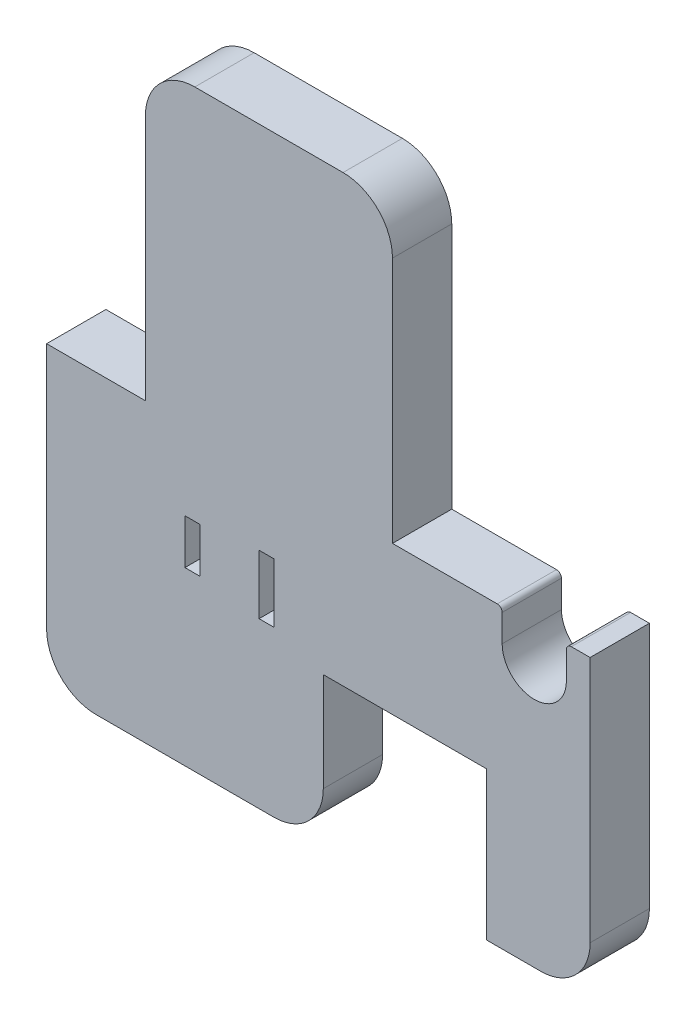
ISO-10303-21;
HEADER;
FILE_DESCRIPTION(('STEP AP214'),'2;1');
FILE_NAME('part.step','',(''),(''),'','','');
FILE_SCHEMA(('AUTOMOTIVE_DESIGN { 1 0 10303 214 1 1 1 1 }'));
ENDSEC;
DATA;
#1=APPLICATION_CONTEXT('core data for automotive mechanical design processes');
#2=APPLICATION_PROTOCOL_DEFINITION('international standard','automotive_design',2000,#1);
#3=PRODUCT_CONTEXT('',#1,'mechanical');
#4=PRODUCT('Part','Part','',(#3));
#5=PRODUCT_RELATED_PRODUCT_CATEGORY('part','',(#4));
#6=PRODUCT_DEFINITION_FORMATION('','',#4);
#7=PRODUCT_DEFINITION_CONTEXT('part definition',#1,'design');
#8=PRODUCT_DEFINITION('design','',#6,#7);
#9=PRODUCT_DEFINITION_SHAPE('','',#8);
#10=(LENGTH_UNIT() NAMED_UNIT(*) SI_UNIT(.MILLI.,.METRE.));
#11=(NAMED_UNIT(*) PLANE_ANGLE_UNIT() SI_UNIT($,.RADIAN.));
#12=(NAMED_UNIT(*) SI_UNIT($,.STERADIAN.) SOLID_ANGLE_UNIT());
#13=UNCERTAINTY_MEASURE_WITH_UNIT(LENGTH_MEASURE(1.E-05),#10,'distance_accuracy_value','');
#14=(GEOMETRIC_REPRESENTATION_CONTEXT(3) GLOBAL_UNCERTAINTY_ASSIGNED_CONTEXT((#13)) GLOBAL_UNIT_ASSIGNED_CONTEXT((#10,
#11,#12)) REPRESENTATION_CONTEXT('',''));
#15=CARTESIAN_POINT('',(0.,0.,0.));
#16=DIRECTION('',(0.,0.,1.));
#17=DIRECTION('',(1.,0.,0.));
#18=AXIS2_PLACEMENT_3D('',#15,#16,#17);
#19=CARTESIAN_POINT('',(65.,30.,-12.));
#20=DIRECTION('',(0.,1.,0.));
#21=DIRECTION('',(-1.,0.,0.));
#22=AXIS2_PLACEMENT_3D('',#19,#20,#21);
#23=PLANE('',#22);
#24=DIRECTION('',(-1.,0.,0.));
#25=VECTOR('',#24,1.);
#26=CARTESIAN_POINT('',(65.,30.,0.));
#27=LINE('',#26,#25);
#28=CARTESIAN_POINT('',(46.2,30.,0.));
#29=VERTEX_POINT('',#28);
#30=CARTESIAN_POINT('',(25.,30.,0.));
#31=VERTEX_POINT('',#30);
#32=EDGE_CURVE('E392',#29,#31,#27,.T.);
#33=ORIENTED_EDGE('',*,*,#32,.F.);
#34=DIRECTION('',(0.,0.,1.));
#35=VECTOR('',#34,1.);
#36=CARTESIAN_POINT('',(46.2,30.,-12.));
#37=LINE('',#36,#35);
#38=CARTESIAN_POINT('',(46.2,30.,-12.));
#39=VERTEX_POINT('',#38);
#40=EDGE_CURVE('E11',#29,#39,#37,.F.);
#41=ORIENTED_EDGE('',*,*,#40,.T.);
#42=DIRECTION('',(-1.,0.,0.));
#43=VECTOR('',#42,1.);
#44=CARTESIAN_POINT('',(65.,30.,-12.));
#45=LINE('',#44,#43);
#46=CARTESIAN_POINT('',(25.,30.,-12.));
#47=VERTEX_POINT('',#46);
#48=EDGE_CURVE('E358',#39,#47,#45,.T.);
#49=ORIENTED_EDGE('',*,*,#48,.T.);
#50=DIRECTION('',(0.,0.,1.));
#51=VECTOR('',#50,1.);
#52=CARTESIAN_POINT('',(25.,30.,-12.));
#53=LINE('',#52,#51);
#54=EDGE_CURVE('E406',#47,#31,#53,.T.);
#55=ORIENTED_EDGE('',*,*,#54,.T.);
#56=EDGE_LOOP('',(#33,#41,#49,#55));
#57=FACE_BOUND('',#56,.T.);
#58=ADVANCED_FACE('F33',(#57),#23,.T.);
#59=CARTESIAN_POINT('',(-25.,30.,-12.));
#60=DIRECTION('',(0.,1.,0.));
#61=DIRECTION('',(-1.,0.,0.));
#62=AXIS2_PLACEMENT_3D('',#59,#60,#61);
#63=PLANE('',#62);
#64=DIRECTION('',(-1.,0.,0.));
#65=VECTOR('',#64,1.);
#66=CARTESIAN_POINT('',(-25.,30.,0.));
#67=LINE('',#66,#65);
#68=CARTESIAN_POINT('',(-25.,30.,0.));
#69=VERTEX_POINT('',#68);
#70=CARTESIAN_POINT('',(-45.,30.,0.));
#71=VERTEX_POINT('',#70);
#72=EDGE_CURVE('E328',#69,#71,#67,.T.);
#73=ORIENTED_EDGE('',*,*,#72,.F.);
#74=DIRECTION('',(0.,0.,1.));
#75=VECTOR('',#74,1.);
#76=CARTESIAN_POINT('',(-25.,30.,-12.));
#77=LINE('',#76,#75);
#78=CARTESIAN_POINT('',(-25.,30.,-12.));
#79=VERTEX_POINT('',#78);
#80=EDGE_CURVE('E402',#79,#69,#77,.T.);
#81=ORIENTED_EDGE('',*,*,#80,.F.);
#82=DIRECTION('',(-1.,0.,0.));
#83=VECTOR('',#82,1.);
#84=CARTESIAN_POINT('',(-25.,30.,-12.));
#85=LINE('',#84,#83);
#86=CARTESIAN_POINT('',(-45.,30.,-12.));
#87=VERTEX_POINT('',#86);
#88=EDGE_CURVE('E335',#79,#87,#85,.T.);
#89=ORIENTED_EDGE('',*,*,#88,.T.);
#90=DIRECTION('',(0.,0.,1.));
#91=VECTOR('',#90,1.);
#92=CARTESIAN_POINT('',(-45.,30.,-12.));
#93=LINE('',#92,#91);
#94=EDGE_CURVE('E370',#87,#71,#93,.T.);
#95=ORIENTED_EDGE('',*,*,#94,.T.);
#96=EDGE_LOOP('',(#73,#81,#89,#95));
#97=FACE_BOUND('',#96,.T.);
#98=ADVANCED_FACE('F517',(#97),#63,.T.);
#99=CARTESIAN_POINT('',(-25.,90.,-12.));
#100=DIRECTION('',(-1.,0.,0.));
#101=DIRECTION('',(0.,0.,1.));
#102=AXIS2_PLACEMENT_3D('',#99,#100,#101);
#103=PLANE('',#102);
#104=DIRECTION('',(0.,-1.,0.));
#105=VECTOR('',#104,1.);
#106=CARTESIAN_POINT('',(-25.,90.,0.));
#107=LINE('',#106,#105);
#108=CARTESIAN_POINT('',(-25.,80.,0.));
#109=VERTEX_POINT('',#108);
#110=EDGE_CURVE('E339',#109,#69,#107,.T.);
#111=ORIENTED_EDGE('',*,*,#110,.F.);
#112=DIRECTION('',(0.,0.,1.));
#113=VECTOR('',#112,1.);
#114=CARTESIAN_POINT('',(-25.,80.,-12.));
#115=LINE('',#114,#113);
#116=CARTESIAN_POINT('',(-25.,80.,-12.));
#117=VERTEX_POINT('',#116);
#118=EDGE_CURVE('E453',#109,#117,#115,.F.);
#119=ORIENTED_EDGE('',*,*,#118,.T.);
#120=DIRECTION('',(0.,-1.,0.));
#121=VECTOR('',#120,1.);
#122=CARTESIAN_POINT('',(-25.,90.,-12.));
#123=LINE('',#122,#121);
#124=EDGE_CURVE('E368',#117,#79,#123,.T.);
#125=ORIENTED_EDGE('',*,*,#124,.T.);
#126=ORIENTED_EDGE('',*,*,#80,.T.);
#127=EDGE_LOOP('',(#111,#119,#125,#126));
#128=FACE_BOUND('',#127,.T.);
#129=ADVANCED_FACE('F512',(#128),#103,.T.);
#130=CARTESIAN_POINT('',(25.,90.,-12.));
#131=DIRECTION('',(0.,1.,0.));
#132=DIRECTION('',(0.,0.,1.));
#133=AXIS2_PLACEMENT_3D('',#130,#131,#132);
#134=PLANE('',#133);
#135=DIRECTION('',(-1.,0.,0.));
#136=VECTOR('',#135,1.);
#137=CARTESIAN_POINT('',(25.,90.,0.));
#138=LINE('',#137,#136);
#139=CARTESIAN_POINT('',(15.,90.,0.));
#140=VERTEX_POINT('',#139);
#141=CARTESIAN_POINT('',(-15.,90.,0.));
#142=VERTEX_POINT('',#141);
#143=EDGE_CURVE('E398',#140,#142,#138,.T.);
#144=ORIENTED_EDGE('',*,*,#143,.F.);
#145=DIRECTION('',(0.,0.,1.));
#146=VECTOR('',#145,1.);
#147=CARTESIAN_POINT('',(15.,90.,-12.));
#148=LINE('',#147,#146);
#149=CARTESIAN_POINT('',(15.,90.,-12.));
#150=VERTEX_POINT('',#149);
#151=EDGE_CURVE('E451',#140,#150,#148,.F.);
#152=ORIENTED_EDGE('',*,*,#151,.T.);
#153=DIRECTION('',(-1.,0.,0.));
#154=VECTOR('',#153,1.);
#155=CARTESIAN_POINT('',(25.,90.,-12.));
#156=LINE('',#155,#154);
#157=CARTESIAN_POINT('',(-15.,90.,-12.));
#158=VERTEX_POINT('',#157);
#159=EDGE_CURVE('E365',#150,#158,#156,.T.);
#160=ORIENTED_EDGE('',*,*,#159,.T.);
#161=DIRECTION('',(0.,0.,1.));
#162=VECTOR('',#161,1.);
#163=CARTESIAN_POINT('',(-15.,90.,-12.));
#164=LINE('',#163,#162);
#165=EDGE_CURVE('E448',#158,#142,#164,.T.);
#166=ORIENTED_EDGE('',*,*,#165,.T.);
#167=EDGE_LOOP('',(#144,#152,#160,#166));
#168=FACE_BOUND('',#167,.T.);
#169=ADVANCED_FACE('F500',(#168),#134,.T.);
#170=CARTESIAN_POINT('',(25.,30.,-12.));
#171=DIRECTION('',(1.,0.,0.));
#172=DIRECTION('',(0.,1.,0.));
#173=AXIS2_PLACEMENT_3D('',#170,#171,#172);
#174=PLANE('',#173);
#175=DIRECTION('',(0.,1.,0.));
#176=VECTOR('',#175,1.);
#177=CARTESIAN_POINT('',(25.,30.,-12.));
#178=LINE('',#177,#176);
#179=CARTESIAN_POINT('',(25.,80.,-12.));
#180=VERTEX_POINT('',#179);
#181=EDGE_CURVE('E362',#47,#180,#178,.T.);
#182=ORIENTED_EDGE('',*,*,#181,.T.);
#183=DIRECTION('',(0.,0.,1.));
#184=VECTOR('',#183,1.);
#185=CARTESIAN_POINT('',(25.,80.,-12.));
#186=LINE('',#185,#184);
#187=CARTESIAN_POINT('',(25.,80.,0.));
#188=VERTEX_POINT('',#187);
#189=EDGE_CURVE('E445',#180,#188,#186,.T.);
#190=ORIENTED_EDGE('',*,*,#189,.T.);
#191=DIRECTION('',(0.,1.,0.));
#192=VECTOR('',#191,1.);
#193=CARTESIAN_POINT('',(25.,30.,0.));
#194=LINE('',#193,#192);
#195=EDGE_CURVE('E395',#31,#188,#194,.T.);
#196=ORIENTED_EDGE('',*,*,#195,.F.);
#197=ORIENTED_EDGE('',*,*,#54,.F.);
#198=EDGE_LOOP('',(#182,#190,#196,#197));
#199=FACE_BOUND('',#198,.T.);
#200=ADVANCED_FACE('F494',(#199),#174,.T.);
#201=CARTESIAN_POINT('',(65.,30.,-12.));
#202=VERTEX_POINT('',#201);
#203=CARTESIAN_POINT('',(61.2,30.,-12.));
#204=VERTEX_POINT('',#203);
#205=EDGE_CURVE('E359',#202,#204,#45,.T.);
#206=ORIENTED_EDGE('',*,*,#205,.T.);
#207=DIRECTION('',(0.,0.,1.));
#208=VECTOR('',#207,1.);
#209=CARTESIAN_POINT('',(61.2,30.,0.));
#210=LINE('',#209,#208);
#211=CARTESIAN_POINT('',(61.2,30.,0.));
#212=VERTEX_POINT('',#211);
#213=EDGE_CURVE('E464',#204,#212,#210,.T.);
#214=ORIENTED_EDGE('',*,*,#213,.T.);
#215=CARTESIAN_POINT('',(65.,30.,0.));
#216=VERTEX_POINT('',#215);
#217=EDGE_CURVE('E393',#216,#212,#27,.T.);
#218=ORIENTED_EDGE('',*,*,#217,.F.);
#219=DIRECTION('',(0.,0.,1.));
#220=VECTOR('',#219,1.);
#221=CARTESIAN_POINT('',(65.,30.,-12.));
#222=LINE('',#221,#220);
#223=EDGE_CURVE('E409',#202,#216,#222,.T.);
#224=ORIENTED_EDGE('',*,*,#223,.F.);
#225=EDGE_LOOP('',(#206,#214,#218,#224));
#226=FACE_BOUND('',#225,.T.);
#227=ADVANCED_FACE('F484',(#226),#23,.T.);
#228=CARTESIAN_POINT('',(65.,-30.,-12.));
#229=DIRECTION('',(1.,0.,0.));
#230=DIRECTION('',(0.,0.,-1.));
#231=AXIS2_PLACEMENT_3D('',#228,#229,#230);
#232=PLANE('',#231);
#233=DIRECTION('',(0.,1.,0.));
#234=VECTOR('',#233,1.);
#235=CARTESIAN_POINT('',(65.,-30.,0.));
#236=LINE('',#235,#234);
#237=CARTESIAN_POINT('',(65.,-20.,0.));
#238=VERTEX_POINT('',#237);
#239=EDGE_CURVE('E390',#238,#216,#236,.T.);
#240=ORIENTED_EDGE('',*,*,#239,.F.);
#241=DIRECTION('',(0.,0.,1.));
#242=VECTOR('',#241,1.);
#243=CARTESIAN_POINT('',(65.,-20.,-12.));
#244=LINE('',#243,#242);
#245=CARTESIAN_POINT('',(65.,-20.,-12.));
#246=VERTEX_POINT('',#245);
#247=EDGE_CURVE('E430',#238,#246,#244,.F.);
#248=ORIENTED_EDGE('',*,*,#247,.T.);
#249=DIRECTION('',(0.,1.,0.));
#250=VECTOR('',#249,1.);
#251=CARTESIAN_POINT('',(65.,-30.,-12.));
#252=LINE('',#251,#250);
#253=EDGE_CURVE('E356',#246,#202,#252,.T.);
#254=ORIENTED_EDGE('',*,*,#253,.T.);
#255=ORIENTED_EDGE('',*,*,#223,.T.);
#256=EDGE_LOOP('',(#240,#248,#254,#255));
#257=FACE_BOUND('',#256,.T.);
#258=ADVANCED_FACE('F560',(#257),#232,.T.);
#259=CARTESIAN_POINT('',(44.,-30.,-12.));
#260=DIRECTION('',(0.,-1.,0.));
#261=DIRECTION('',(1.,0.,0.));
#262=AXIS2_PLACEMENT_3D('',#259,#260,#261);
#263=PLANE('',#262);
#264=DIRECTION('',(1.,0.,0.));
#265=VECTOR('',#264,1.);
#266=CARTESIAN_POINT('',(44.,-30.,-12.));
#267=LINE('',#266,#265);
#268=CARTESIAN_POINT('',(44.,-30.,-12.));
#269=VERTEX_POINT('',#268);
#270=CARTESIAN_POINT('',(55.,-30.,-12.));
#271=VERTEX_POINT('',#270);
#272=EDGE_CURVE('E353',#269,#271,#267,.T.);
#273=ORIENTED_EDGE('',*,*,#272,.T.);
#274=DIRECTION('',(0.,0.,1.));
#275=VECTOR('',#274,1.);
#276=CARTESIAN_POINT('',(55.,-30.,-12.));
#277=LINE('',#276,#275);
#278=CARTESIAN_POINT('',(55.,-30.,0.));
#279=VERTEX_POINT('',#278);
#280=EDGE_CURVE('E405',#271,#279,#277,.T.);
#281=ORIENTED_EDGE('',*,*,#280,.T.);
#282=DIRECTION('',(1.,0.,0.));
#283=VECTOR('',#282,1.);
#284=CARTESIAN_POINT('',(44.,-30.,0.));
#285=LINE('',#284,#283);
#286=CARTESIAN_POINT('',(44.,-30.,0.));
#287=VERTEX_POINT('',#286);
#288=EDGE_CURVE('E387',#287,#279,#285,.T.);
#289=ORIENTED_EDGE('',*,*,#288,.F.);
#290=DIRECTION('',(0.,0.,1.));
#291=VECTOR('',#290,1.);
#292=CARTESIAN_POINT('',(44.,-30.,-12.));
#293=LINE('',#292,#291);
#294=EDGE_CURVE('E412',#269,#287,#293,.T.);
#295=ORIENTED_EDGE('',*,*,#294,.F.);
#296=EDGE_LOOP('',(#273,#281,#289,#295));
#297=FACE_BOUND('',#296,.T.);
#298=ADVANCED_FACE('F552',(#297),#263,.T.);
#299=CARTESIAN_POINT('',(44.,0.,-12.));
#300=DIRECTION('',(-1.,0.,0.));
#301=DIRECTION('',(0.,-1.,0.));
#302=AXIS2_PLACEMENT_3D('',#299,#300,#301);
#303=PLANE('',#302);
#304=DIRECTION('',(0.,-1.,0.));
#305=VECTOR('',#304,1.);
#306=CARTESIAN_POINT('',(44.,0.,0.));
#307=LINE('',#306,#305);
#308=CARTESIAN_POINT('',(44.,0.,0.));
#309=VERTEX_POINT('',#308);
#310=EDGE_CURVE('E384',#309,#287,#307,.T.);
#311=ORIENTED_EDGE('',*,*,#310,.F.);
#312=DIRECTION('',(0.,0.,1.));
#313=VECTOR('',#312,1.);
#314=CARTESIAN_POINT('',(44.,0.,-12.));
#315=LINE('',#314,#313);
#316=CARTESIAN_POINT('',(44.,0.,-12.));
#317=VERTEX_POINT('',#316);
#318=EDGE_CURVE('E414',#317,#309,#315,.T.);
#319=ORIENTED_EDGE('',*,*,#318,.F.);
#320=DIRECTION('',(0.,-1.,0.));
#321=VECTOR('',#320,1.);
#322=CARTESIAN_POINT('',(44.,0.,-12.));
#323=LINE('',#322,#321);
#324=EDGE_CURVE('E350',#317,#269,#323,.T.);
#325=ORIENTED_EDGE('',*,*,#324,.T.);
#326=ORIENTED_EDGE('',*,*,#294,.T.);
#327=EDGE_LOOP('',(#311,#319,#325,#326));
#328=FACE_BOUND('',#327,.T.);
#329=ADVANCED_FACE('F548',(#328),#303,.T.);
#330=CARTESIAN_POINT('',(11.,0.,-12.));
#331=DIRECTION('',(0.,-1.,0.));
#332=DIRECTION('',(0.,0.,-1.));
#333=AXIS2_PLACEMENT_3D('',#330,#331,#332);
#334=PLANE('',#333);
#335=DIRECTION('',(1.,0.,0.));
#336=VECTOR('',#335,1.);
#337=CARTESIAN_POINT('',(11.,0.,0.));
#338=LINE('',#337,#336);
#339=CARTESIAN_POINT('',(11.,0.,0.));
#340=VERTEX_POINT('',#339);
#341=EDGE_CURVE('E381',#340,#309,#338,.T.);
#342=ORIENTED_EDGE('',*,*,#341,.F.);
#343=DIRECTION('',(0.,0.,1.));
#344=VECTOR('',#343,1.);
#345=CARTESIAN_POINT('',(11.,0.,-12.));
#346=LINE('',#345,#344);
#347=CARTESIAN_POINT('',(11.,0.,-12.));
#348=VERTEX_POINT('',#347);
#349=EDGE_CURVE('E416',#348,#340,#346,.T.);
#350=ORIENTED_EDGE('',*,*,#349,.F.);
#351=DIRECTION('',(1.,0.,0.));
#352=VECTOR('',#351,1.);
#353=CARTESIAN_POINT('',(11.,0.,-12.));
#354=LINE('',#353,#352);
#355=EDGE_CURVE('E347',#348,#317,#354,.T.);
#356=ORIENTED_EDGE('',*,*,#355,.T.);
#357=ORIENTED_EDGE('',*,*,#318,.T.);
#358=EDGE_LOOP('',(#342,#350,#356,#357));
#359=FACE_BOUND('',#358,.T.);
#360=ADVANCED_FACE('F544',(#359),#334,.T.);
#361=CARTESIAN_POINT('',(11.,-30.,-12.));
#362=DIRECTION('',(1.,0.,0.));
#363=DIRECTION('',(0.,0.,-1.));
#364=AXIS2_PLACEMENT_3D('',#361,#362,#363);
#365=PLANE('',#364);
#366=DIRECTION('',(0.,1.,0.));
#367=VECTOR('',#366,1.);
#368=CARTESIAN_POINT('',(11.,-30.,0.));
#369=LINE('',#368,#367);
#370=CARTESIAN_POINT('',(11.,-20.,0.));
#371=VERTEX_POINT('',#370);
#372=EDGE_CURVE('E379',#371,#340,#369,.T.);
#373=ORIENTED_EDGE('',*,*,#372,.F.);
#374=DIRECTION('',(0.,0.,1.));
#375=VECTOR('',#374,1.);
#376=CARTESIAN_POINT('',(11.,-20.,-12.));
#377=LINE('',#376,#375);
#378=CARTESIAN_POINT('',(11.,-20.,-12.));
#379=VERTEX_POINT('',#378);
#380=EDGE_CURVE('E460',#371,#379,#377,.F.);
#381=ORIENTED_EDGE('',*,*,#380,.T.);
#382=DIRECTION('',(0.,1.,0.));
#383=VECTOR('',#382,1.);
#384=CARTESIAN_POINT('',(11.,-30.,-12.));
#385=LINE('',#384,#383);
#386=EDGE_CURVE('E345',#379,#348,#385,.T.);
#387=ORIENTED_EDGE('',*,*,#386,.T.);
#388=ORIENTED_EDGE('',*,*,#349,.T.);
#389=EDGE_LOOP('',(#373,#381,#387,#388));
#390=FACE_BOUND('',#389,.T.);
#391=ADVANCED_FACE('F540',(#390),#365,.T.);
#392=CARTESIAN_POINT('',(-45.,-30.,-12.));
#393=DIRECTION('',(0.,-1.,0.));
#394=DIRECTION('',(0.,0.,-1.));
#395=AXIS2_PLACEMENT_3D('',#392,#393,#394);
#396=PLANE('',#395);
#397=DIRECTION('',(1.,0.,0.));
#398=VECTOR('',#397,1.);
#399=CARTESIAN_POINT('',(-45.,-30.,-12.));
#400=LINE('',#399,#398);
#401=CARTESIAN_POINT('',(-35.,-30.,-12.));
#402=VERTEX_POINT('',#401);
#403=CARTESIAN_POINT('',(1.00000000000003,-30.,-12.));
#404=VERTEX_POINT('',#403);
#405=EDGE_CURVE('E342',#402,#404,#400,.T.);
#406=ORIENTED_EDGE('',*,*,#405,.T.);
#407=DIRECTION('',(0.,0.,1.));
#408=VECTOR('',#407,1.);
#409=CARTESIAN_POINT('',(1.00000000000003,-30.,-12.));
#410=LINE('',#409,#408);
#411=CARTESIAN_POINT('',(1.00000000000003,-30.,0.));
#412=VERTEX_POINT('',#411);
#413=EDGE_CURVE('E455',#404,#412,#410,.T.);
#414=ORIENTED_EDGE('',*,*,#413,.T.);
#415=DIRECTION('',(1.,0.,0.));
#416=VECTOR('',#415,1.);
#417=CARTESIAN_POINT('',(-45.,-30.,0.));
#418=LINE('',#417,#416);
#419=CARTESIAN_POINT('',(-35.,-30.,0.));
#420=VERTEX_POINT('',#419);
#421=EDGE_CURVE('E376',#420,#412,#418,.T.);
#422=ORIENTED_EDGE('',*,*,#421,.F.);
#423=DIRECTION('',(0.,0.,1.));
#424=VECTOR('',#423,1.);
#425=CARTESIAN_POINT('',(-35.,-30.,-12.));
#426=LINE('',#425,#424);
#427=EDGE_CURVE('E443',#420,#402,#426,.F.);
#428=ORIENTED_EDGE('',*,*,#427,.T.);
#429=EDGE_LOOP('',(#406,#414,#422,#428));
#430=FACE_BOUND('',#429,.T.);
#431=ADVANCED_FACE('F530',(#430),#396,.T.);
#432=CARTESIAN_POINT('',(-45.,30.,-12.));
#433=DIRECTION('',(-1.,0.,0.));
#434=DIRECTION('',(0.,-1.,0.));
#435=AXIS2_PLACEMENT_3D('',#432,#433,#434);
#436=PLANE('',#435);
#437=DIRECTION('',(0.,-1.,0.));
#438=VECTOR('',#437,1.);
#439=CARTESIAN_POINT('',(-45.,30.,-12.));
#440=LINE('',#439,#438);
#441=CARTESIAN_POINT('',(-45.,-20.,-12.));
#442=VERTEX_POINT('',#441);
#443=EDGE_CURVE('E338',#87,#442,#440,.T.);
#444=ORIENTED_EDGE('',*,*,#443,.T.);
#445=DIRECTION('',(0.,0.,1.));
#446=VECTOR('',#445,1.);
#447=CARTESIAN_POINT('',(-45.,-20.,-12.));
#448=LINE('',#447,#446);
#449=CARTESIAN_POINT('',(-45.,-20.,0.));
#450=VERTEX_POINT('',#449);
#451=EDGE_CURVE('E440',#442,#450,#448,.T.);
#452=ORIENTED_EDGE('',*,*,#451,.T.);
#453=DIRECTION('',(0.,-1.,0.));
#454=VECTOR('',#453,1.);
#455=CARTESIAN_POINT('',(-45.,30.,0.));
#456=LINE('',#455,#454);
#457=EDGE_CURVE('E373',#71,#450,#456,.T.);
#458=ORIENTED_EDGE('',*,*,#457,.F.);
#459=ORIENTED_EDGE('',*,*,#94,.F.);
#460=EDGE_LOOP('',(#444,#452,#458,#459));
#461=FACE_BOUND('',#460,.T.);
#462=ADVANCED_FACE('F521',(#461),#436,.T.);
#463=CARTESIAN_POINT('',(0.,0.,-12.));
#464=DIRECTION('',(0.,0.,1.));
#465=DIRECTION('',(1.,0.,0.));
#466=AXIS2_PLACEMENT_3D('',#463,#464,#465);
#467=PLANE('',#466);
#468=DIRECTION('',(-1.,0.,0.));
#469=VECTOR('',#468,1.);
#470=CARTESIAN_POINT('',(-2.,15.3,-12.));
#471=LINE('',#470,#469);
#472=CARTESIAN_POINT('',(1.,15.3,-12.));
#473=VERTEX_POINT('',#472);
#474=CARTESIAN_POINT('',(-2.,15.3,-12.));
#475=VERTEX_POINT('',#474);
#476=EDGE_CURVE('E281',#473,#475,#471,.T.);
#477=ORIENTED_EDGE('',*,*,#476,.T.);
#478=DIRECTION('',(0.,-1.,0.));
#479=VECTOR('',#478,1.);
#480=CARTESIAN_POINT('',(-2.,15.3,-12.));
#481=LINE('',#480,#479);
#482=CARTESIAN_POINT('',(-2.,3.30000000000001,-12.));
#483=VERTEX_POINT('',#482);
#484=EDGE_CURVE('E271',#475,#483,#481,.T.);
#485=ORIENTED_EDGE('',*,*,#484,.T.);
#486=DIRECTION('',(1.,0.,0.));
#487=VECTOR('',#486,1.);
#488=CARTESIAN_POINT('',(-2.,3.30000000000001,-12.));
#489=LINE('',#488,#487);
#490=CARTESIAN_POINT('',(1.,3.30000000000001,-12.));
#491=VERTEX_POINT('',#490);
#492=EDGE_CURVE('E274',#483,#491,#489,.T.);
#493=ORIENTED_EDGE('',*,*,#492,.T.);
#494=DIRECTION('',(0.,1.,0.));
#495=VECTOR('',#494,1.);
#496=CARTESIAN_POINT('',(1.,15.3,-12.));
#497=LINE('',#496,#495);
#498=EDGE_CURVE('E278',#491,#473,#497,.T.);
#499=ORIENTED_EDGE('',*,*,#498,.T.);
#500=EDGE_LOOP('',(#477,#485,#493,#499));
#501=FACE_BOUND('',#500,.T.);
#502=DIRECTION('',(-1.,0.,0.));
#503=VECTOR('',#502,1.);
#504=CARTESIAN_POINT('',(-17.,13.845,-12.));
#505=LINE('',#504,#503);
#506=CARTESIAN_POINT('',(-14.,13.845,-12.));
#507=VERTEX_POINT('',#506);
#508=CARTESIAN_POINT('',(-17.,13.845,-12.));
#509=VERTEX_POINT('',#508);
#510=EDGE_CURVE('E313',#507,#509,#505,.T.);
#511=ORIENTED_EDGE('',*,*,#510,.T.);
#512=DIRECTION('',(0.,-1.,0.));
#513=VECTOR('',#512,1.);
#514=CARTESIAN_POINT('',(-17.,13.845,-12.));
#515=LINE('',#514,#513);
#516=CARTESIAN_POINT('',(-17.,4.75500000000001,-12.));
#517=VERTEX_POINT('',#516);
#518=EDGE_CURVE('E303',#509,#517,#515,.T.);
#519=ORIENTED_EDGE('',*,*,#518,.T.);
#520=DIRECTION('',(1.,0.,0.));
#521=VECTOR('',#520,1.);
#522=CARTESIAN_POINT('',(-17.,4.75500000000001,-12.));
#523=LINE('',#522,#521);
#524=CARTESIAN_POINT('',(-14.,4.75500000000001,-12.));
#525=VERTEX_POINT('',#524);
#526=EDGE_CURVE('E306',#517,#525,#523,.T.);
#527=ORIENTED_EDGE('',*,*,#526,.T.);
#528=DIRECTION('',(0.,1.,0.));
#529=VECTOR('',#528,1.);
#530=CARTESIAN_POINT('',(-14.,13.845,-12.));
#531=LINE('',#530,#529);
#532=EDGE_CURVE('E310',#525,#507,#531,.T.);
#533=ORIENTED_EDGE('',*,*,#532,.T.);
#534=EDGE_LOOP('',(#511,#519,#527,#533));
#535=FACE_BOUND('',#534,.T.);
#536=DIRECTION('',(0.,1.,0.));
#537=VECTOR('',#536,1.);
#538=CARTESIAN_POINT('',(60.2,0.,-12.));
#539=LINE('',#538,#537);
#540=CARTESIAN_POINT('',(60.2,23.5,-12.));
#541=VERTEX_POINT('',#540);
#542=CARTESIAN_POINT('',(60.2,29.,-12.));
#543=VERTEX_POINT('',#542);
#544=EDGE_CURVE('E254',#541,#543,#539,.T.);
#545=ORIENTED_EDGE('',*,*,#544,.T.);
#546=CARTESIAN_POINT('',(61.2,29.,-12.));
#547=DIRECTION('',(0.,0.,1.));
#548=DIRECTION('',(1.,0.,0.));
#549=AXIS2_PLACEMENT_3D('',#546,#547,#548);
#550=CIRCLE('',#549,1.);
#551=EDGE_CURVE('E474',#543,#204,#550,.F.);
#552=ORIENTED_EDGE('',*,*,#551,.T.);
#553=ORIENTED_EDGE('',*,*,#205,.F.);
#554=ORIENTED_EDGE('',*,*,#253,.F.);
#555=CARTESIAN_POINT('',(55.,-20.,-12.));
#556=DIRECTION('',(0.,0.,1.));
#557=DIRECTION('',(1.,0.,0.));
#558=AXIS2_PLACEMENT_3D('',#555,#556,#557);
#559=CIRCLE('',#558,10.);
#560=EDGE_CURVE('E438',#246,#271,#559,.F.);
#561=ORIENTED_EDGE('',*,*,#560,.T.);
#562=ORIENTED_EDGE('',*,*,#272,.F.);
#563=ORIENTED_EDGE('',*,*,#324,.F.);
#564=ORIENTED_EDGE('',*,*,#355,.F.);
#565=ORIENTED_EDGE('',*,*,#386,.F.);
#566=CARTESIAN_POINT('',(1.00000000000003,-20.,-12.));
#567=DIRECTION('',(0.,0.,1.));
#568=DIRECTION('',(1.,0.,0.));
#569=AXIS2_PLACEMENT_3D('',#566,#567,#568);
#570=CIRCLE('',#569,10.);
#571=EDGE_CURVE('E462',#379,#404,#570,.F.);
#572=ORIENTED_EDGE('',*,*,#571,.T.);
#573=ORIENTED_EDGE('',*,*,#405,.F.);
#574=CARTESIAN_POINT('',(-35.,-20.,-12.));
#575=DIRECTION('',(0.,0.,1.));
#576=DIRECTION('',(1.,0.,0.));
#577=AXIS2_PLACEMENT_3D('',#574,#575,#576);
#578=CIRCLE('',#577,10.);
#579=EDGE_CURVE('E436',#402,#442,#578,.F.);
#580=ORIENTED_EDGE('',*,*,#579,.T.);
#581=ORIENTED_EDGE('',*,*,#443,.F.);
#582=ORIENTED_EDGE('',*,*,#88,.F.);
#583=ORIENTED_EDGE('',*,*,#124,.F.);
#584=CARTESIAN_POINT('',(-15.,80.,-12.));
#585=DIRECTION('',(0.,0.,1.));
#586=DIRECTION('',(1.,0.,0.));
#587=AXIS2_PLACEMENT_3D('',#584,#585,#586);
#588=CIRCLE('',#587,10.);
#589=EDGE_CURVE('E432',#117,#158,#588,.F.);
#590=ORIENTED_EDGE('',*,*,#589,.T.);
#591=ORIENTED_EDGE('',*,*,#159,.F.);
#592=CARTESIAN_POINT('',(15.,80.,-12.));
#593=DIRECTION('',(0.,0.,1.));
#594=DIRECTION('',(1.,0.,0.));
#595=AXIS2_PLACEMENT_3D('',#592,#593,#594);
#596=CIRCLE('',#595,10.);
#597=EDGE_CURVE('E434',#150,#180,#596,.F.);
#598=ORIENTED_EDGE('',*,*,#597,.T.);
#599=ORIENTED_EDGE('',*,*,#181,.F.);
#600=ORIENTED_EDGE('',*,*,#48,.F.);
#601=CARTESIAN_POINT('',(46.2,29.,-12.));
#602=DIRECTION('',(0.,0.,1.));
#603=DIRECTION('',(1.,0.,0.));
#604=AXIS2_PLACEMENT_3D('',#601,#602,#603);
#605=CIRCLE('',#604,1.);
#606=CARTESIAN_POINT('',(47.2,29.,-12.));
#607=VERTEX_POINT('',#606);
#608=EDGE_CURVE('E48',#39,#607,#605,.F.);
#609=ORIENTED_EDGE('',*,*,#608,.T.);
#610=DIRECTION('',(0.,-1.,0.));
#611=VECTOR('',#610,1.);
#612=CARTESIAN_POINT('',(47.2,0.,-12.));
#613=LINE('',#612,#611);
#614=CARTESIAN_POINT('',(47.2,23.5,-12.));
#615=VERTEX_POINT('',#614);
#616=EDGE_CURVE('E267',#607,#615,#613,.T.);
#617=ORIENTED_EDGE('',*,*,#616,.T.);
#618=CARTESIAN_POINT('',(53.7,23.5,-12.));
#619=DIRECTION('',(0.,0.,1.));
#620=DIRECTION('',(1.,0.,0.));
#621=AXIS2_PLACEMENT_3D('',#618,#619,#620);
#622=CIRCLE('',#621,6.5);
#623=EDGE_CURVE('E253',#615,#541,#622,.T.);
#624=ORIENTED_EDGE('',*,*,#623,.T.);
#625=EDGE_LOOP('',(#545,#552,#553,#554,#561,#562,#563,#564,#565,#572,#573,#580,#581,#582,#583,
#590,#591,#598,#599,#600,#609,#617,#624));
#626=FACE_BOUND('',#625,.T.);
#627=ADVANCED_FACE('F477',(#501,#535,#626),#467,.F.);
#628=CARTESIAN_POINT('',(0.,0.,0.));
#629=DIRECTION('',(0.,0.,1.));
#630=DIRECTION('',(1.,0.,0.));
#631=AXIS2_PLACEMENT_3D('',#628,#629,#630);
#632=PLANE('',#631);
#633=ORIENTED_EDGE('',*,*,#217,.T.);
#634=CARTESIAN_POINT('',(61.2,29.,0.));
#635=DIRECTION('',(0.,0.,1.));
#636=DIRECTION('',(1.,0.,0.));
#637=AXIS2_PLACEMENT_3D('',#634,#635,#636);
#638=CIRCLE('',#637,1.);
#639=CARTESIAN_POINT('',(60.2,29.,0.));
#640=VERTEX_POINT('',#639);
#641=EDGE_CURVE('E469',#212,#640,#638,.T.);
#642=ORIENTED_EDGE('',*,*,#641,.T.);
#643=DIRECTION('',(0.,1.,0.));
#644=VECTOR('',#643,1.);
#645=CARTESIAN_POINT('',(60.2,23.5,0.));
#646=LINE('',#645,#644);
#647=CARTESIAN_POINT('',(60.2,23.5,0.));
#648=VERTEX_POINT('',#647);
#649=EDGE_CURVE('E244',#648,#640,#646,.T.);
#650=ORIENTED_EDGE('',*,*,#649,.F.);
#651=CARTESIAN_POINT('',(53.7,23.5,0.));
#652=DIRECTION('',(0.,0.,1.));
#653=DIRECTION('',(1.,0.,0.));
#654=AXIS2_PLACEMENT_3D('',#651,#652,#653);
#655=CIRCLE('',#654,6.5);
#656=CARTESIAN_POINT('',(47.2,23.5,0.));
#657=VERTEX_POINT('',#656);
#658=EDGE_CURVE('E250',#657,#648,#655,.T.);
#659=ORIENTED_EDGE('',*,*,#658,.F.);
#660=DIRECTION('',(0.,-1.,0.));
#661=VECTOR('',#660,1.);
#662=CARTESIAN_POINT('',(47.2,30.,0.));
#663=LINE('',#662,#661);
#664=CARTESIAN_POINT('',(47.2,29.,0.));
#665=VERTEX_POINT('',#664);
#666=EDGE_CURVE('E236',#665,#657,#663,.T.);
#667=ORIENTED_EDGE('',*,*,#666,.F.);
#668=CARTESIAN_POINT('',(46.2,29.,0.));
#669=DIRECTION('',(0.,0.,1.));
#670=DIRECTION('',(1.,0.,0.));
#671=AXIS2_PLACEMENT_3D('',#668,#669,#670);
#672=CIRCLE('',#671,1.);
#673=EDGE_CURVE('E467',#665,#29,#672,.T.);
#674=ORIENTED_EDGE('',*,*,#673,.T.);
#675=ORIENTED_EDGE('',*,*,#32,.T.);
#676=ORIENTED_EDGE('',*,*,#195,.T.);
#677=CARTESIAN_POINT('',(15.,80.,0.));
#678=DIRECTION('',(0.,0.,1.));
#679=DIRECTION('',(1.,0.,0.));
#680=AXIS2_PLACEMENT_3D('',#677,#678,#679);
#681=CIRCLE('',#680,10.);
#682=EDGE_CURVE('E424',#188,#140,#681,.T.);
#683=ORIENTED_EDGE('',*,*,#682,.T.);
#684=ORIENTED_EDGE('',*,*,#143,.T.);
#685=CARTESIAN_POINT('',(-15.,80.,0.));
#686=DIRECTION('',(0.,0.,1.));
#687=DIRECTION('',(1.,0.,0.));
#688=AXIS2_PLACEMENT_3D('',#685,#686,#687);
#689=CIRCLE('',#688,10.);
#690=EDGE_CURVE('E422',#142,#109,#689,.T.);
#691=ORIENTED_EDGE('',*,*,#690,.T.);
#692=ORIENTED_EDGE('',*,*,#110,.T.);
#693=ORIENTED_EDGE('',*,*,#72,.T.);
#694=ORIENTED_EDGE('',*,*,#457,.T.);
#695=CARTESIAN_POINT('',(-35.,-20.,0.));
#696=DIRECTION('',(0.,0.,1.));
#697=DIRECTION('',(1.,0.,0.));
#698=AXIS2_PLACEMENT_3D('',#695,#696,#697);
#699=CIRCLE('',#698,10.);
#700=EDGE_CURVE('E426',#450,#420,#699,.T.);
#701=ORIENTED_EDGE('',*,*,#700,.T.);
#702=ORIENTED_EDGE('',*,*,#421,.T.);
#703=CARTESIAN_POINT('',(1.00000000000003,-20.,0.));
#704=DIRECTION('',(0.,0.,1.));
#705=DIRECTION('',(1.,0.,0.));
#706=AXIS2_PLACEMENT_3D('',#703,#704,#705);
#707=CIRCLE('',#706,10.);
#708=EDGE_CURVE('E458',#412,#371,#707,.T.);
#709=ORIENTED_EDGE('',*,*,#708,.T.);
#710=ORIENTED_EDGE('',*,*,#372,.T.);
#711=ORIENTED_EDGE('',*,*,#341,.T.);
#712=ORIENTED_EDGE('',*,*,#310,.T.);
#713=ORIENTED_EDGE('',*,*,#288,.T.);
#714=CARTESIAN_POINT('',(55.,-20.,0.));
#715=DIRECTION('',(0.,0.,1.));
#716=DIRECTION('',(1.,0.,0.));
#717=AXIS2_PLACEMENT_3D('',#714,#715,#716);
#718=CIRCLE('',#717,10.);
#719=EDGE_CURVE('E428',#279,#238,#718,.T.);
#720=ORIENTED_EDGE('',*,*,#719,.T.);
#721=ORIENTED_EDGE('',*,*,#239,.T.);
#722=EDGE_LOOP('',(#633,#642,#650,#659,#667,#674,#675,#676,#683,#684,#691,#692,#693,#694,#701,
#702,#709,#710,#711,#712,#713,#720,#721));
#723=FACE_BOUND('',#722,.T.);
#724=DIRECTION('',(0.,-1.,0.));
#725=VECTOR('',#724,1.);
#726=CARTESIAN_POINT('',(-2.,15.3,0.));
#727=LINE('',#726,#725);
#728=CARTESIAN_POINT('',(-2.,15.3,0.));
#729=VERTEX_POINT('',#728);
#730=CARTESIAN_POINT('',(-2.,3.30000000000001,0.));
#731=VERTEX_POINT('',#730);
#732=EDGE_CURVE('E270',#729,#731,#727,.T.);
#733=ORIENTED_EDGE('',*,*,#732,.F.);
#734=DIRECTION('',(-1.,0.,0.));
#735=VECTOR('',#734,1.);
#736=CARTESIAN_POINT('',(-2.,15.3,0.));
#737=LINE('',#736,#735);
#738=CARTESIAN_POINT('',(1.,15.3,0.));
#739=VERTEX_POINT('',#738);
#740=EDGE_CURVE('E275',#739,#729,#737,.T.);
#741=ORIENTED_EDGE('',*,*,#740,.F.);
#742=DIRECTION('',(0.,1.,0.));
#743=VECTOR('',#742,1.);
#744=CARTESIAN_POINT('',(1.,15.3,0.));
#745=LINE('',#744,#743);
#746=CARTESIAN_POINT('',(1.,3.30000000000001,0.));
#747=VERTEX_POINT('',#746);
#748=EDGE_CURVE('E289',#747,#739,#745,.T.);
#749=ORIENTED_EDGE('',*,*,#748,.F.);
#750=DIRECTION('',(1.,0.,0.));
#751=VECTOR('',#750,1.);
#752=CARTESIAN_POINT('',(-2.,3.30000000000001,0.));
#753=LINE('',#752,#751);
#754=EDGE_CURVE('E286',#731,#747,#753,.T.);
#755=ORIENTED_EDGE('',*,*,#754,.F.);
#756=EDGE_LOOP('',(#733,#741,#749,#755));
#757=FACE_BOUND('',#756,.T.);
#758=DIRECTION('',(0.,-1.,0.));
#759=VECTOR('',#758,1.);
#760=CARTESIAN_POINT('',(-17.,13.845,0.));
#761=LINE('',#760,#759);
#762=CARTESIAN_POINT('',(-17.,13.845,0.));
#763=VERTEX_POINT('',#762);
#764=CARTESIAN_POINT('',(-17.,4.75500000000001,0.));
#765=VERTEX_POINT('',#764);
#766=EDGE_CURVE('E296',#763,#765,#761,.T.);
#767=ORIENTED_EDGE('',*,*,#766,.F.);
#768=DIRECTION('',(-1.,0.,0.));
#769=VECTOR('',#768,1.);
#770=CARTESIAN_POINT('',(-17.,13.845,0.));
#771=LINE('',#770,#769);
#772=CARTESIAN_POINT('',(-14.,13.845,0.));
#773=VERTEX_POINT('',#772);
#774=EDGE_CURVE('E307',#773,#763,#771,.T.);
#775=ORIENTED_EDGE('',*,*,#774,.F.);
#776=DIRECTION('',(0.,1.,0.));
#777=VECTOR('',#776,1.);
#778=CARTESIAN_POINT('',(-14.,13.845,0.));
#779=LINE('',#778,#777);
#780=CARTESIAN_POINT('',(-14.,4.75500000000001,0.));
#781=VERTEX_POINT('',#780);
#782=EDGE_CURVE('E321',#781,#773,#779,.T.);
#783=ORIENTED_EDGE('',*,*,#782,.F.);
#784=DIRECTION('',(1.,0.,0.));
#785=VECTOR('',#784,1.);
#786=CARTESIAN_POINT('',(-17.,4.75500000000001,0.));
#787=LINE('',#786,#785);
#788=EDGE_CURVE('E318',#765,#781,#787,.T.);
#789=ORIENTED_EDGE('',*,*,#788,.F.);
#790=EDGE_LOOP('',(#767,#775,#783,#789));
#791=FACE_BOUND('',#790,.T.);
#792=ADVANCED_FACE('F258',(#723,#757,#791),#632,.T.);
#793=CARTESIAN_POINT('',(-17.,13.845,-12.));
#794=DIRECTION('',(-1.,0.,0.));
#795=DIRECTION('',(0.,0.,1.));
#796=AXIS2_PLACEMENT_3D('',#793,#794,#795);
#797=PLANE('',#796);
#798=ORIENTED_EDGE('',*,*,#766,.T.);
#799=DIRECTION('',(0.,0.,1.));
#800=VECTOR('',#799,1.);
#801=CARTESIAN_POINT('',(-17.,4.75500000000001,-12.));
#802=LINE('',#801,#800);
#803=EDGE_CURVE('E316',#517,#765,#802,.T.);
#804=ORIENTED_EDGE('',*,*,#803,.F.);
#805=ORIENTED_EDGE('',*,*,#518,.F.);
#806=DIRECTION('',(0.,0.,1.));
#807=VECTOR('',#806,1.);
#808=CARTESIAN_POINT('',(-17.,13.845,-12.));
#809=LINE('',#808,#807);
#810=EDGE_CURVE('E326',#509,#763,#809,.T.);
#811=ORIENTED_EDGE('',*,*,#810,.T.);
#812=EDGE_LOOP('',(#798,#804,#805,#811));
#813=FACE_BOUND('',#812,.T.);
#814=ADVANCED_FACE('F583',(#813),#797,.F.);
#815=CARTESIAN_POINT('',(-17.,13.845,-12.));
#816=DIRECTION('',(0.,1.,0.));
#817=DIRECTION('',(-1.,0.,0.));
#818=AXIS2_PLACEMENT_3D('',#815,#816,#817);
#819=PLANE('',#818);
#820=ORIENTED_EDGE('',*,*,#774,.T.);
#821=ORIENTED_EDGE('',*,*,#810,.F.);
#822=ORIENTED_EDGE('',*,*,#510,.F.);
#823=DIRECTION('',(0.,0.,1.));
#824=VECTOR('',#823,1.);
#825=CARTESIAN_POINT('',(-14.,13.845,-12.));
#826=LINE('',#825,#824);
#827=EDGE_CURVE('E329',#507,#773,#826,.T.);
#828=ORIENTED_EDGE('',*,*,#827,.T.);
#829=EDGE_LOOP('',(#820,#821,#822,#828));
#830=FACE_BOUND('',#829,.T.);
#831=ADVANCED_FACE('F589',(#830),#819,.F.);
#832=CARTESIAN_POINT('',(-14.,13.845,-12.));
#833=DIRECTION('',(1.,0.,0.));
#834=DIRECTION('',(0.,0.,-1.));
#835=AXIS2_PLACEMENT_3D('',#832,#833,#834);
#836=PLANE('',#835);
#837=ORIENTED_EDGE('',*,*,#782,.T.);
#838=ORIENTED_EDGE('',*,*,#827,.F.);
#839=ORIENTED_EDGE('',*,*,#532,.F.);
#840=DIRECTION('',(0.,0.,1.));
#841=VECTOR('',#840,1.);
#842=CARTESIAN_POINT('',(-14.,4.75500000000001,-12.));
#843=LINE('',#842,#841);
#844=EDGE_CURVE('E331',#525,#781,#843,.T.);
#845=ORIENTED_EDGE('',*,*,#844,.T.);
#846=EDGE_LOOP('',(#837,#838,#839,#845));
#847=FACE_BOUND('',#846,.T.);
#848=ADVANCED_FACE('F595',(#847),#836,.F.);
#849=CARTESIAN_POINT('',(-17.,4.75500000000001,-12.));
#850=DIRECTION('',(0.,-1.,0.));
#851=DIRECTION('',(0.,0.,-1.));
#852=AXIS2_PLACEMENT_3D('',#849,#850,#851);
#853=PLANE('',#852);
#854=ORIENTED_EDGE('',*,*,#788,.T.);
#855=ORIENTED_EDGE('',*,*,#844,.F.);
#856=ORIENTED_EDGE('',*,*,#526,.F.);
#857=ORIENTED_EDGE('',*,*,#803,.T.);
#858=EDGE_LOOP('',(#854,#855,#856,#857));
#859=FACE_BOUND('',#858,.T.);
#860=ADVANCED_FACE('F591',(#859),#853,.F.);
#861=CARTESIAN_POINT('',(-2.,15.3,-12.));
#862=DIRECTION('',(-1.,0.,0.));
#863=DIRECTION('',(0.,-1.,0.));
#864=AXIS2_PLACEMENT_3D('',#861,#862,#863);
#865=PLANE('',#864);
#866=ORIENTED_EDGE('',*,*,#732,.T.);
#867=DIRECTION('',(0.,0.,1.));
#868=VECTOR('',#867,1.);
#869=CARTESIAN_POINT('',(-2.,3.30000000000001,-12.));
#870=LINE('',#869,#868);
#871=EDGE_CURVE('E284',#483,#731,#870,.T.);
#872=ORIENTED_EDGE('',*,*,#871,.F.);
#873=ORIENTED_EDGE('',*,*,#484,.F.);
#874=DIRECTION('',(0.,0.,1.));
#875=VECTOR('',#874,1.);
#876=CARTESIAN_POINT('',(-2.,15.3,-12.));
#877=LINE('',#876,#875);
#878=EDGE_CURVE('E294',#475,#729,#877,.T.);
#879=ORIENTED_EDGE('',*,*,#878,.T.);
#880=EDGE_LOOP('',(#866,#872,#873,#879));
#881=FACE_BOUND('',#880,.T.);
#882=ADVANCED_FACE('F594',(#881),#865,.F.);
#883=CARTESIAN_POINT('',(-2.,15.3,-12.));
#884=DIRECTION('',(0.,1.,0.));
#885=DIRECTION('',(-1.,0.,0.));
#886=AXIS2_PLACEMENT_3D('',#883,#884,#885);
#887=PLANE('',#886);
#888=ORIENTED_EDGE('',*,*,#740,.T.);
#889=ORIENTED_EDGE('',*,*,#878,.F.);
#890=ORIENTED_EDGE('',*,*,#476,.F.);
#891=DIRECTION('',(0.,0.,1.));
#892=VECTOR('',#891,1.);
#893=CARTESIAN_POINT('',(1.,15.3,-12.));
#894=LINE('',#893,#892);
#895=EDGE_CURVE('E297',#473,#739,#894,.T.);
#896=ORIENTED_EDGE('',*,*,#895,.T.);
#897=EDGE_LOOP('',(#888,#889,#890,#896));
#898=FACE_BOUND('',#897,.T.);
#899=ADVANCED_FACE('F605',(#898),#887,.F.);
#900=CARTESIAN_POINT('',(1.,15.3,-12.));
#901=DIRECTION('',(1.,0.,0.));
#902=DIRECTION('',(0.,1.,0.));
#903=AXIS2_PLACEMENT_3D('',#900,#901,#902);
#904=PLANE('',#903);
#905=ORIENTED_EDGE('',*,*,#748,.T.);
#906=ORIENTED_EDGE('',*,*,#895,.F.);
#907=ORIENTED_EDGE('',*,*,#498,.F.);
#908=DIRECTION('',(0.,0.,1.));
#909=VECTOR('',#908,1.);
#910=CARTESIAN_POINT('',(1.,3.30000000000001,-12.));
#911=LINE('',#910,#909);
#912=EDGE_CURVE('E299',#491,#747,#911,.T.);
#913=ORIENTED_EDGE('',*,*,#912,.T.);
#914=EDGE_LOOP('',(#905,#906,#907,#913));
#915=FACE_BOUND('',#914,.T.);
#916=ADVANCED_FACE('F610',(#915),#904,.F.);
#917=CARTESIAN_POINT('',(-2.,3.30000000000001,-12.));
#918=DIRECTION('',(0.,-1.,0.));
#919=DIRECTION('',(1.,0.,0.));
#920=AXIS2_PLACEMENT_3D('',#917,#918,#919);
#921=PLANE('',#920);
#922=ORIENTED_EDGE('',*,*,#754,.T.);
#923=ORIENTED_EDGE('',*,*,#912,.F.);
#924=ORIENTED_EDGE('',*,*,#492,.F.);
#925=ORIENTED_EDGE('',*,*,#871,.T.);
#926=EDGE_LOOP('',(#922,#923,#924,#925));
#927=FACE_BOUND('',#926,.T.);
#928=ADVANCED_FACE('F607',(#927),#921,.F.);
#929=CARTESIAN_POINT('',(55.,-20.,-12.));
#930=DIRECTION('',(0.,0.,1.));
#931=DIRECTION('',(1.,0.,0.));
#932=AXIS2_PLACEMENT_3D('',#929,#930,#931);
#933=CYLINDRICAL_SURFACE('',#932,10.);
#934=ORIENTED_EDGE('',*,*,#560,.F.);
#935=ORIENTED_EDGE('',*,*,#247,.F.);
#936=ORIENTED_EDGE('',*,*,#719,.F.);
#937=ORIENTED_EDGE('',*,*,#280,.F.);
#938=EDGE_LOOP('',(#934,#935,#936,#937));
#939=FACE_BOUND('',#938,.T.);
#940=ADVANCED_FACE('F556',(#939),#933,.T.);
#941=CARTESIAN_POINT('',(-35.,-20.,-12.));
#942=DIRECTION('',(0.,0.,1.));
#943=DIRECTION('',(1.,0.,0.));
#944=AXIS2_PLACEMENT_3D('',#941,#942,#943);
#945=CYLINDRICAL_SURFACE('',#944,10.);
#946=ORIENTED_EDGE('',*,*,#579,.F.);
#947=ORIENTED_EDGE('',*,*,#427,.F.);
#948=ORIENTED_EDGE('',*,*,#700,.F.);
#949=ORIENTED_EDGE('',*,*,#451,.F.);
#950=EDGE_LOOP('',(#946,#947,#948,#949));
#951=FACE_BOUND('',#950,.T.);
#952=ADVANCED_FACE('F526',(#951),#945,.T.);
#953=CARTESIAN_POINT('',(15.,80.,-12.));
#954=DIRECTION('',(0.,0.,1.));
#955=DIRECTION('',(1.,0.,0.));
#956=AXIS2_PLACEMENT_3D('',#953,#954,#955);
#957=CYLINDRICAL_SURFACE('',#956,10.);
#958=ORIENTED_EDGE('',*,*,#597,.F.);
#959=ORIENTED_EDGE('',*,*,#151,.F.);
#960=ORIENTED_EDGE('',*,*,#682,.F.);
#961=ORIENTED_EDGE('',*,*,#189,.F.);
#962=EDGE_LOOP('',(#958,#959,#960,#961));
#963=FACE_BOUND('',#962,.T.);
#964=ADVANCED_FACE('F504',(#963),#957,.T.);
#965=CARTESIAN_POINT('',(-15.,80.,-12.));
#966=DIRECTION('',(0.,0.,1.));
#967=DIRECTION('',(1.,0.,0.));
#968=AXIS2_PLACEMENT_3D('',#965,#966,#967);
#969=CYLINDRICAL_SURFACE('',#968,10.);
#970=ORIENTED_EDGE('',*,*,#589,.F.);
#971=ORIENTED_EDGE('',*,*,#118,.F.);
#972=ORIENTED_EDGE('',*,*,#690,.F.);
#973=ORIENTED_EDGE('',*,*,#165,.F.);
#974=EDGE_LOOP('',(#970,#971,#972,#973));
#975=FACE_BOUND('',#974,.T.);
#976=ADVANCED_FACE('F508',(#975),#969,.T.);
#977=CARTESIAN_POINT('',(1.00000000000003,-20.,-12.));
#978=DIRECTION('',(0.,0.,1.));
#979=DIRECTION('',(1.,0.,0.));
#980=AXIS2_PLACEMENT_3D('',#977,#978,#979);
#981=CYLINDRICAL_SURFACE('',#980,10.);
#982=ORIENTED_EDGE('',*,*,#571,.F.);
#983=ORIENTED_EDGE('',*,*,#380,.F.);
#984=ORIENTED_EDGE('',*,*,#708,.F.);
#985=ORIENTED_EDGE('',*,*,#413,.F.);
#986=EDGE_LOOP('',(#982,#983,#984,#985));
#987=FACE_BOUND('',#986,.T.);
#988=ADVANCED_FACE('F537',(#987),#981,.T.);
#989=CARTESIAN_POINT('',(53.7,23.5,-25.));
#990=DIRECTION('',(0.,0.,1.));
#991=DIRECTION('',(1.,0.,0.));
#992=AXIS2_PLACEMENT_3D('',#989,#990,#991);
#993=CYLINDRICAL_SURFACE('',#992,6.5);
#994=DIRECTION('',(0.,0.,1.));
#995=VECTOR('',#994,1.);
#996=CARTESIAN_POINT('',(47.2,23.5,-25.));
#997=LINE('',#996,#995);
#998=EDGE_CURVE('E239',#615,#657,#997,.T.);
#999=ORIENTED_EDGE('',*,*,#998,.T.);
#1000=ORIENTED_EDGE('',*,*,#658,.T.);
#1001=DIRECTION('',(0.,0.,1.));
#1002=VECTOR('',#1001,1.);
#1003=CARTESIAN_POINT('',(60.2,23.5,-25.));
#1004=LINE('',#1003,#1002);
#1005=EDGE_CURVE('E243',#541,#648,#1004,.T.);
#1006=ORIENTED_EDGE('',*,*,#1005,.F.);
#1007=ORIENTED_EDGE('',*,*,#623,.F.);
#1008=EDGE_LOOP('',(#999,#1000,#1006,#1007));
#1009=FACE_BOUND('',#1008,.T.);
#1010=ADVANCED_FACE('F248',(#1009),#993,.F.);
#1011=CARTESIAN_POINT('',(47.2,30.,-25.));
#1012=DIRECTION('',(-1.,0.,0.));
#1013=DIRECTION('',(0.,0.,1.));
#1014=AXIS2_PLACEMENT_3D('',#1011,#1012,#1013);
#1015=PLANE('',#1014);
#1016=ORIENTED_EDGE('',*,*,#616,.F.);
#1017=DIRECTION('',(0.,0.,1.));
#1018=VECTOR('',#1017,1.);
#1019=CARTESIAN_POINT('',(47.2,29.,0.));
#1020=LINE('',#1019,#1018);
#1021=EDGE_CURVE('E41',#607,#665,#1020,.T.);
#1022=ORIENTED_EDGE('',*,*,#1021,.T.);
#1023=ORIENTED_EDGE('',*,*,#666,.T.);
#1024=ORIENTED_EDGE('',*,*,#998,.F.);
#1025=EDGE_LOOP('',(#1016,#1022,#1023,#1024));
#1026=FACE_BOUND('',#1025,.T.);
#1027=ADVANCED_FACE('F238',(#1026),#1015,.F.);
#1028=CARTESIAN_POINT('',(60.2,23.5,-25.));
#1029=DIRECTION('',(1.,0.,0.));
#1030=DIRECTION('',(0.,1.,0.));
#1031=AXIS2_PLACEMENT_3D('',#1028,#1029,#1030);
#1032=PLANE('',#1031);
#1033=ORIENTED_EDGE('',*,*,#649,.T.);
#1034=DIRECTION('',(0.,0.,1.));
#1035=VECTOR('',#1034,1.);
#1036=CARTESIAN_POINT('',(60.2,29.,-12.));
#1037=LINE('',#1036,#1035);
#1038=EDGE_CURVE('E471',#640,#543,#1037,.F.);
#1039=ORIENTED_EDGE('',*,*,#1038,.T.);
#1040=ORIENTED_EDGE('',*,*,#544,.F.);
#1041=ORIENTED_EDGE('',*,*,#1005,.T.);
#1042=EDGE_LOOP('',(#1033,#1039,#1040,#1041));
#1043=FACE_BOUND('',#1042,.T.);
#1044=ADVANCED_FACE('F488',(#1043),#1032,.F.);
#1045=CARTESIAN_POINT('',(61.2,29.,-12.));
#1046=DIRECTION('',(0.,0.,-1.));
#1047=DIRECTION('',(-1.,0.,0.));
#1048=AXIS2_PLACEMENT_3D('',#1045,#1046,#1047);
#1049=CYLINDRICAL_SURFACE('',#1048,1.);
#1050=ORIENTED_EDGE('',*,*,#551,.F.);
#1051=ORIENTED_EDGE('',*,*,#1038,.F.);
#1052=ORIENTED_EDGE('',*,*,#641,.F.);
#1053=ORIENTED_EDGE('',*,*,#213,.F.);
#1054=EDGE_LOOP('',(#1050,#1051,#1052,#1053));
#1055=FACE_BOUND('',#1054,.T.);
#1056=ADVANCED_FACE('F486',(#1055),#1049,.T.);
#1057=CARTESIAN_POINT('',(46.2,29.,-25.));
#1058=DIRECTION('',(0.,0.,-1.));
#1059=DIRECTION('',(-1.,0.,0.));
#1060=AXIS2_PLACEMENT_3D('',#1057,#1058,#1059);
#1061=CYLINDRICAL_SURFACE('',#1060,1.);
#1062=ORIENTED_EDGE('',*,*,#608,.F.);
#1063=ORIENTED_EDGE('',*,*,#40,.F.);
#1064=ORIENTED_EDGE('',*,*,#673,.F.);
#1065=ORIENTED_EDGE('',*,*,#1021,.F.);
#1066=EDGE_LOOP('',(#1062,#1063,#1064,#1065));
#1067=FACE_BOUND('',#1066,.T.);
#1068=ADVANCED_FACE('F35',(#1067),#1061,.T.);
#1069=CLOSED_SHELL('',(#58,#98,#129,#169,#200,#227,#258,#298,#329,#360,#391,#431,#462,#627,#792,
#814,#831,#848,#860,#882,#899,#916,#928,#940,#952,#964,#976,#988,#1010,#1027,#1044,#1056,#1068));
#1070=MANIFOLD_SOLID_BREP('B2',#1069);
#1071=ADVANCED_BREP_SHAPE_REPRESENTATION('',(#18,#1070),#14);
#1072=SHAPE_DEFINITION_REPRESENTATION(#9,#1071);
ENDSEC;
END-ISO-10303-21;
